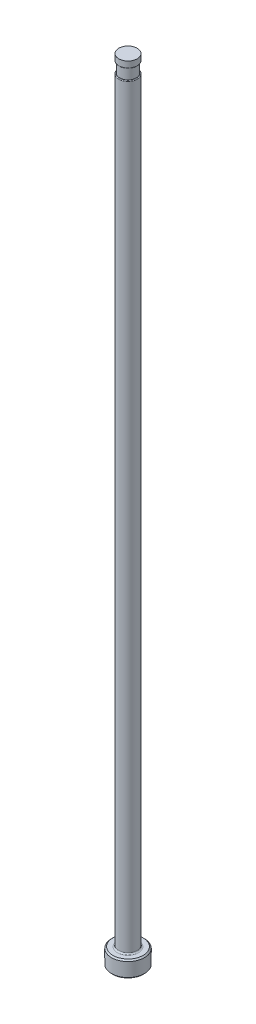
from build123d import *

# Parameters (mm, degrees)
CHAMFER1_SIZE     = 0.254
FILLET1_R         = 0.254
SKETCH2_W         = 0.2032
SKETCH2_H         = 2.032
D_SLOT_DEPTH      = 153.466131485
D_SLOT_DEPTH_BACK = 153.466131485
SKETCH5_W         = 0.0127
SKETCH5_H         = 1.27
FILLET2_R         = 0.127


with BuildPart() as part:
    # Sketch1 → Revolve1 (revolve)
    with BuildSketch(Plane.XY, mode=Mode.PRIVATE) as revolve1_sk:
        Polygon((0, 0), (-3.175, 0), (-3.175, 3.175), (-1.78562, 3.175), (-1.78562, 152.4), (0, 152.4), align=None)
    revolve(revolve1_sk.sketch.rotate(Axis((0, 259.958771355, 0), (0, -1, 0)), 270), axis=Axis((0, 259.958771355, 0), (0, -1, 0)))

    # Chamfer1
    chamfer1_edges = [part.edges().sort_by_distance(p)[0] for p in [
        (0, 3.175, -3.175),
        (0, 0, -3.175),
    ]]
    chamfer(chamfer1_edges, length=CHAMFER1_SIZE)

    # Fillet1
    fillet1_edges = [part.edges().sort_by_distance(p)[0] for p in [
        (0, 3.175, -1.78562),
    ]]
    fillet(fillet1_edges, radius=FILLET1_R)

    # Sketch2 → Vent Relief (revolve, cut)
    with BuildSketch(Plane.XY, mode=Mode.PRIVATE) as vent_relief_sk:
        with Locations((-1.68402, 150.114)):
            Rectangle(SKETCH2_W, SKETCH2_H)
    revolve(vent_relief_sk.sketch.rotate(Axis((0, 153.448281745, 0), (0, -1, 0)), 270), axis=Axis((0, 153.448281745, 0), (0, -1, 0)), mode=Mode.SUBTRACT)

    # Sketch3 → D-Slot (cut, two sides: drawn at the far end of the back side and taken through both)
    with BuildSketch(Plane.XY.offset(-D_SLOT_DEPTH_BACK)):
        with BuildLine():
            Line((-1.58242, 150.114), (-1.58242, 86.614))
            ThreePointArc((-1.58242, 86.614), (-1.633633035, 86.046038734), (-1.78562, 85.4964))
            Line((-1.78562, 85.4964), (-1.78562, 150.114))
            Line((-1.78562, 150.114), (-1.58242, 150.114))
        make_face()
    extrude(amount=D_SLOT_DEPTH + D_SLOT_DEPTH_BACK, mode=Mode.SUBTRACT)

    # Sketch5 → Vent Diameter (revolve, cut)
    with BuildSketch(Plane.XY, mode=Mode.PRIVATE) as vent_diameter_sk:
        with Locations((-1.77927, 151.765)):
            Rectangle(SKETCH5_W, SKETCH5_H)
    revolve(vent_diameter_sk.sketch.rotate(Axis((0, 152.687735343, 0), (0, -1, 0)), 90), axis=Axis((0, 152.687735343, 0), (0, -1, 0)), mode=Mode.SUBTRACT)

    # Fillet2
    fillet2_edges = [part.edges().sort_by_distance(p)[0] for p in [
        (1.527357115, 149.098, -0.924996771),
        (0, 151.13, 1.77292),
    ]]
    fillet(fillet2_edges, radius=FILLET2_R)


solid = part.part
